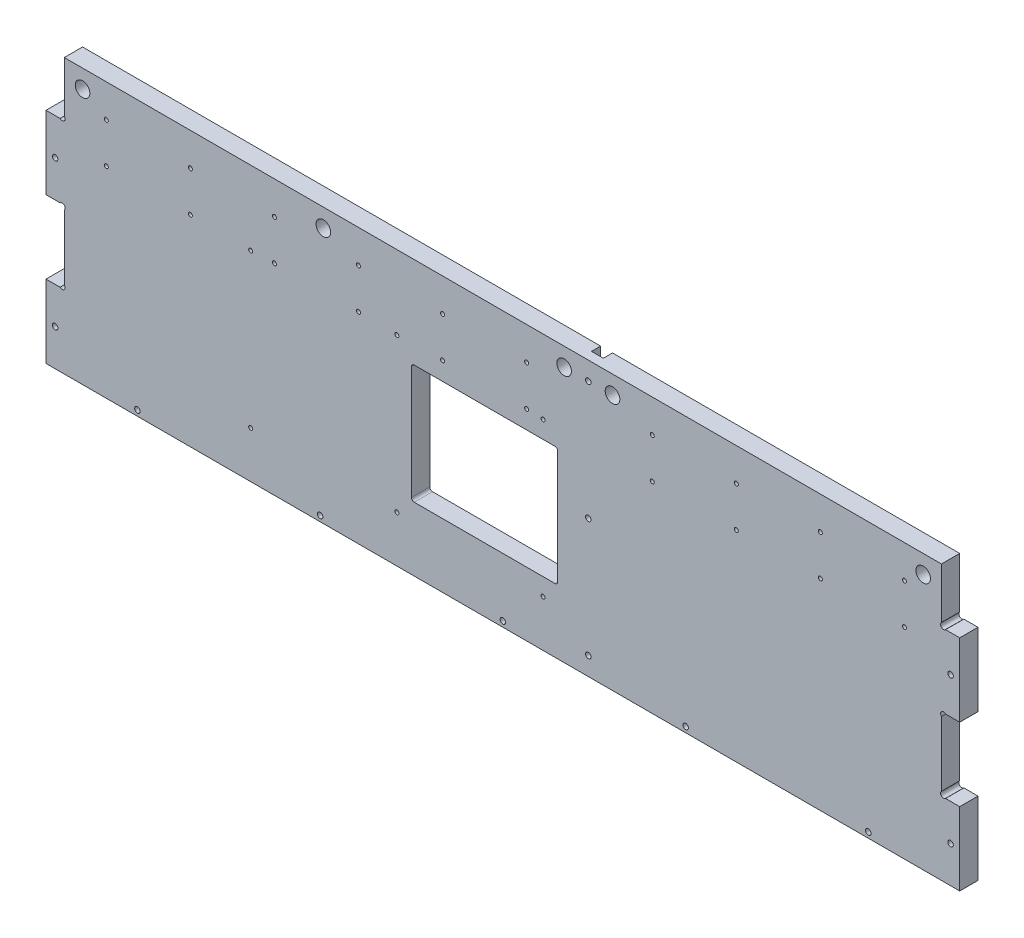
from build123d import *

# Parameters (mm, degrees)
EXTRUSION1_DEPTH                      = 10
ESQUISSE2_R                           = 1.6
ENL_V_MAT_ENFOURCHEMENT_DEPTH         = 523.111099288
ESQUISSE3_R                           = 1.5
ENL_V_MAT_FIXATION_SOL_ET_MURS_DEPTH  = 523.111099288
ENL_V_MAT_FENETRE_DEPTH               = 523.111099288
ESQUISSE6_W                           = 6.5
ESQUISSE6_H                           = 150
ENL_V_MAT_ENCASTREMENT_DEPTH          = 5
ESQUISSE4_R                           = 4
ENL_V_MAT_EXTRU_1_DEPTH               = 523.111099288
ESQUISSE7_R                           = 1.5
ENL_V_MAT_FIXATION_ENCASTREMENT_DEPTH = 523.039270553
ESQUISSE8_R                           = 1.1
ENL_V_MAT_TAME_DEPTH                  = 523.111099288
ESQUISSE9_R                           = 1.1
ENL_V_MAT_FIXATION_GLISSIERE_DEPTH    = 523.111099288


with BuildPart() as part:
    # Esquisse1 → Extrusion1 (new body)
    with BuildSketch(Plane.XY):
        Polygon((0, 0), (500, 0), (500, 40), (490, 40), (490, 80), (500, 80), (500, 120), (490, 120), (490, 150), (10, 150), (10, 120), (0, 120), (0, 80), (10, 80), (10, 40), (0, 40), align=None)
    extrude(amount=EXTRUSION1_DEPTH)

    # Esquisse2 → Enl_v. mat.-enfourchement (cut, through all)
    with BuildSketch(Plane.XY.offset(10)):
        with Locations((8.86862915, 121.13137085)):
            Circle(ESQUISSE2_R)
        with Locations((8.86862915, 78.86862915)):
            Circle(ESQUISSE2_R)
        with Locations((8.86862915, 41.13137085)):
            Circle(ESQUISSE2_R)
        with Locations((491.13137085, 121.13137085)):
            Circle(ESQUISSE2_R)
        with Locations((491.13137085, 78.86862915)):
            Circle(ESQUISSE2_R)
        with Locations((491.13137085, 41.13137085)):
            Circle(ESQUISSE2_R)
    extrude(amount=-ENL_V_MAT_ENFOURCHEMENT_DEPTH, mode=Mode.SUBTRACT)

    # Esquisse3 → Enl_v. mat.-fixation sol et murs (cut, through all)
    with BuildSketch(Plane.XY.offset(10)):
        with Locations((5, 20)):
            Circle(ESQUISSE3_R)
        with Locations((5, 100)):
            Circle(ESQUISSE3_R)
        with Locations((495, 20)):
            Circle(ESQUISSE3_R)
        with Locations((495, 100)):
            Circle(ESQUISSE3_R)
        with Locations((250, 3)):
            Circle(ESQUISSE3_R)
        with Locations((50, 3)):
            Circle(ESQUISSE3_R)
        with Locations((150, 3)):
            Circle(ESQUISSE3_R)
        with Locations((450, 3)):
            Circle(ESQUISSE3_R)
        with Locations((350, 3)):
            Circle(ESQUISSE3_R)
    extrude(amount=-ENL_V_MAT_FIXATION_SOL_ET_MURS_DEPTH, mode=Mode.SUBTRACT)

    # Esquisse5 → Enl_v. mat.-fenetre (cut, through all)
    with BuildSketch(Plane.XY.offset(10)):
        with BuildLine():
            Line((201.5, 35), (278.5, 35))
            ThreePointArc((278.5, 35), (279.560660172, 35.439339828), (280, 36.5))
            Line((280, 36.5), (280, 98.5))
            ThreePointArc((280, 98.5), (279.560660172, 99.560660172), (278.5, 100))
            Line((278.5, 100), (201.5, 100))
            ThreePointArc((201.5, 100), (200.439339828, 99.560660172), (200, 98.5))
            Line((200, 98.5), (200, 36.5))
            ThreePointArc((200, 36.5), (200.439339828, 35.439339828), (201.5, 35))
        make_face()
    extrude(amount=-ENL_V_MAT_FENETRE_DEPTH, mode=Mode.SUBTRACT)

    # Esquisse6 → Enl_v. mat.-Encastrement (cut)
    with BuildSketch(Plane(origin=(0, 0, 0), x_dir=(-1, 0, 0), z_dir=(0, 0, -1))):
        with Locations((-296.75, 75)):
            Rectangle(ESQUISSE6_W, ESQUISSE6_H)
    extrude(amount=-ENL_V_MAT_ENCASTREMENT_DEPTH, mode=Mode.SUBTRACT)

    # Esquisse4 → Enl_v. mat.-Extru.1 (cut, through all)
    with BuildSketch(Plane.XY.offset(10)):
        with Locations((480, 140)):
            Circle(ESQUISSE4_R)
        with Locations((20, 140)):
            Circle(ESQUISSE4_R)
        with Locations((310, 140)):
            Circle(ESQUISSE4_R)
        with Locations((283.5, 140)):
            Circle(ESQUISSE4_R)
        with Locations((151.75, 140)):
            Circle(ESQUISSE4_R)
    extrude(amount=-ENL_V_MAT_EXTRU_1_DEPTH, mode=Mode.SUBTRACT)

    # Esquisse7 → Enl_v. mat.-Fixation encastrement (cut, through all)
    with BuildSketch(Plane(origin=(0, 0, 5), x_dir=(-1, 0, 0), z_dir=(0, 0, -1))):
        with Locations((-296.75, 140)):
            Circle(ESQUISSE7_R)
        with Locations((-296.75, 75)):
            Circle(ESQUISSE7_R)
        with Locations((-296.75, 10)):
            Circle(ESQUISSE7_R)
    extrude(amount=-ENL_V_MAT_FIXATION_ENCASTREMENT_DEPTH, mode=Mode.SUBTRACT)

    # Esquisse8 → Enl_v. mat.-Tame (cut, through all)
    with BuildSketch(Plane(origin=(0, 0, 0), x_dir=(-1, 0, 0), z_dir=(0, 0, -1))):
        with Locations((-263, 132)):
            Circle(ESQUISSE8_R)
        with Locations((-217, 132)):
            Circle(ESQUISSE8_R)
        with Locations((-263, 110)):
            Circle(ESQUISSE8_R)
        with Locations((-217, 110)):
            Circle(ESQUISSE8_R)
        with Locations((-171, 132)):
            Circle(ESQUISSE8_R)
        with Locations((-171, 110)):
            Circle(ESQUISSE8_R)
        with Locations((-125, 132)):
            Circle(ESQUISSE8_R)
        with Locations((-125, 110)):
            Circle(ESQUISSE8_R)
        with Locations((-33, 110)):
            Circle(ESQUISSE8_R)
        with Locations((-33, 132)):
            Circle(ESQUISSE8_R)
        with Locations((-79, 132)):
            Circle(ESQUISSE8_R)
        with Locations((-79, 110)):
            Circle(ESQUISSE8_R)
        with Locations((-377.75, 132)):
            Circle(ESQUISSE8_R)
        with Locations((-423.75, 110)):
            Circle(ESQUISSE8_R)
        with Locations((-423.75, 132)):
            Circle(ESQUISSE8_R)
        with Locations((-377.75, 110)):
            Circle(ESQUISSE8_R)
        with Locations((-469.75, 132)):
            Circle(ESQUISSE8_R)
        with Locations((-469.75, 110)):
            Circle(ESQUISSE8_R)
        with Locations((-331.75, 132)):
            Circle(ESQUISSE8_R)
        with Locations((-331.75, 110)):
            Circle(ESQUISSE8_R)
    extrude(amount=-ENL_V_MAT_TAME_DEPTH, mode=Mode.SUBTRACT)

    # Esquisse9 → Enl_v. mat.-fixation_glissiere (cut, through all)
    with BuildSketch(Plane(origin=(0, 0, 0), x_dir=(-1, 0, 0), z_dir=(0, 0, -1))):
        with Locations((-272, 109.5)):
            Circle(ESQUISSE9_R)
        with Locations((-192, 109.5)):
            Circle(ESQUISSE9_R)
        with Locations((-112, 109.5)):
            Circle(ESQUISSE9_R)
        with Locations((-112, 25.5)):
            Circle(ESQUISSE9_R)
        with Locations((-192, 25.5)):
            Circle(ESQUISSE9_R)
        with Locations((-272, 25.5)):
            Circle(ESQUISSE9_R)
    extrude(amount=-ENL_V_MAT_FIXATION_GLISSIERE_DEPTH, mode=Mode.SUBTRACT)


solid = part.part
